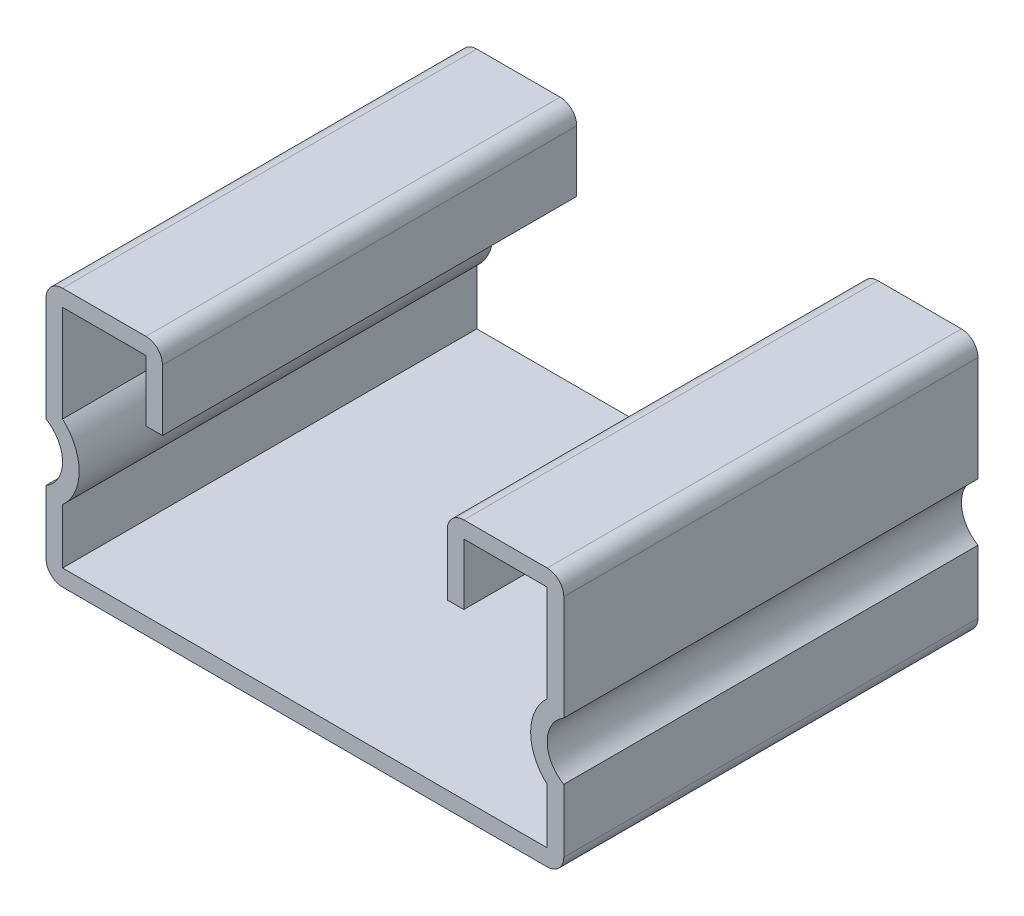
from build123d import *

# Parameters (mm, degrees)
BASE_EXTRUDE_DEPTH = 12.7


with BuildPart() as part:
    # Sketch1 → Base-Extrude (new, symmetric)
    with BuildSketch(Plane.XY):
        with BuildLine():
            Line((-15.875, 8.2042), (-15.875, 1.75976362))
            ThreePointArc((-15.875, 1.75976362), (-14.859, 0), (-15.875, -1.75976362))
            Line((-15.875, -1.75976362), (-15.875, -5.6388))
            ThreePointArc((-15.875, -5.6388), (-15.57742049, -6.35722049), (-14.859, -6.6548))
            Line((-14.859, -6.6548), (14.859, -6.6548))
            ThreePointArc((14.859, -6.6548), (15.57742049, -6.35722049), (15.875, -5.6388))
            Line((15.875, -5.6388), (15.875, -1.75976362))
            ThreePointArc((15.875, -1.75976362), (14.859, 0), (15.875, 1.75976362))
            Line((15.875, 1.75976362), (15.875, 8.2042))
            ThreePointArc((15.875, 8.2042), (15.57742049, 8.92262049), (14.859, 9.2202))
            Line((14.859, 9.2202), (9.74725, 9.2202))
            ThreePointArc((9.74725, 9.2202), (9.02882951, 8.92262049), (8.73125, 8.2042))
            Line((8.73125, 8.2042), (8.73125, 4.4577))
            Line((8.73125, 4.4577), (9.74725, 4.4577))
            Line((9.74725, 4.4577), (9.74725, 8.2042))
            Line((9.74725, 8.2042), (14.859, 8.2042))
            Line((14.859, 8.2042), (14.859, 2.271845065))
            ThreePointArc((14.859, 2.271845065), (13.843, 0), (14.859, -2.271845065))
            Line((14.859, -2.271845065), (14.859, -5.6388))
            Line((14.859, -5.6388), (-14.859, -5.6388))
            Line((-14.859, -5.6388), (-14.859, -2.271845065))
            ThreePointArc((-14.859, -2.271845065), (-13.843, 0), (-14.859, 2.271845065))
            Line((-14.859, 2.271845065), (-14.859, 8.2042))
            Line((-14.859, 8.2042), (-9.74725, 8.2042))
            Line((-9.74725, 8.2042), (-9.74725, 4.4577))
            Line((-9.74725, 4.4577), (-8.73125, 4.4577))
            Line((-8.73125, 4.4577), (-8.73125, 8.2042))
            ThreePointArc((-8.73125, 8.2042), (-9.02882951, 8.92262049), (-9.74725, 9.2202))
            Line((-9.74725, 9.2202), (-14.859, 9.2202))
            ThreePointArc((-14.859, 9.2202), (-15.57742049, 8.92262049), (-15.875, 8.2042))
        make_face()
    extrude(amount=BASE_EXTRUDE_DEPTH, both=True)


solid = part.part
